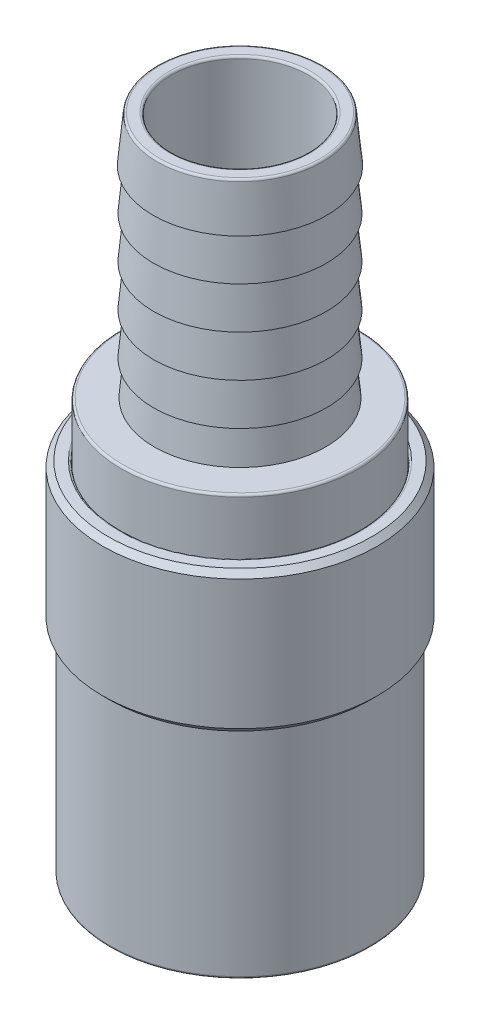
ISO-10303-21;
HEADER;
FILE_DESCRIPTION(('STEP AP214'),'2;1');
FILE_NAME('part.step','',(''),(''),'','','');
FILE_SCHEMA(('AUTOMOTIVE_DESIGN { 1 0 10303 214 1 1 1 1 }'));
ENDSEC;
DATA;
#1=APPLICATION_CONTEXT('core data for automotive mechanical design processes');
#2=APPLICATION_PROTOCOL_DEFINITION('international standard','automotive_design',2000,#1);
#3=PRODUCT_CONTEXT('',#1,'mechanical');
#4=PRODUCT('Part','Part','',(#3));
#5=PRODUCT_RELATED_PRODUCT_CATEGORY('part','',(#4));
#6=PRODUCT_DEFINITION_FORMATION('','',#4);
#7=PRODUCT_DEFINITION_CONTEXT('part definition',#1,'design');
#8=PRODUCT_DEFINITION('design','',#6,#7);
#9=PRODUCT_DEFINITION_SHAPE('','',#8);
#10=(LENGTH_UNIT() NAMED_UNIT(*) SI_UNIT(.MILLI.,.METRE.));
#11=(NAMED_UNIT(*) PLANE_ANGLE_UNIT() SI_UNIT($,.RADIAN.));
#12=(NAMED_UNIT(*) SI_UNIT($,.STERADIAN.) SOLID_ANGLE_UNIT());
#13=UNCERTAINTY_MEASURE_WITH_UNIT(LENGTH_MEASURE(1.E-05),#10,'distance_accuracy_value','');
#14=(GEOMETRIC_REPRESENTATION_CONTEXT(3) GLOBAL_UNCERTAINTY_ASSIGNED_CONTEXT((#13)) GLOBAL_UNIT_ASSIGNED_CONTEXT((#10,
#11,#12)) REPRESENTATION_CONTEXT('',''));
#15=CARTESIAN_POINT('',(0.,0.,0.));
#16=DIRECTION('',(0.,0.,1.));
#17=DIRECTION('',(1.,0.,0.));
#18=AXIS2_PLACEMENT_3D('',#15,#16,#17);
#19=CARTESIAN_POINT('',(0.,75.946,0.));
#20=DIRECTION('',(0.,1.,0.));
#21=DIRECTION('',(0.,0.,1.));
#22=AXIS2_PLACEMENT_3D('',#19,#20,#21);
#23=TOROIDAL_SURFACE('',#22,8.1788,0.254);
#24=CARTESIAN_POINT('',(0.,75.946,0.));
#25=DIRECTION('',(0.,-1.,0.));
#26=DIRECTION('',(0.,0.,-1.));
#27=AXIS2_PLACEMENT_3D('',#24,#25,#26);
#28=CIRCLE('',#27,7.9248);
#29=CARTESIAN_POINT('',(0.,75.946,7.9248));
#30=VERTEX_POINT('',#29);
#31=CARTESIAN_POINT('',(0.,75.946,-7.9248));
#32=VERTEX_POINT('',#31);
#33=EDGE_CURVE('P0_E11',#30,#32,#28,.T.);
#34=ORIENTED_EDGE('',*,*,#33,.T.);
#35=CARTESIAN_POINT('',(0.,75.946,-8.1788));
#36=DIRECTION('',(-1.,0.,0.));
#37=DIRECTION('',(0.,0.,-1.));
#38=AXIS2_PLACEMENT_3D('',#35,#36,#37);
#39=CIRCLE('',#38,0.254);
#40=CARTESIAN_POINT('',(0.,76.2,-8.1788));
#41=VERTEX_POINT('',#40);
#42=EDGE_CURVE('P0_E27',#32,#41,#39,.T.);
#43=ORIENTED_EDGE('',*,*,#42,.T.);
#44=CARTESIAN_POINT('',(0.,76.2,0.));
#45=DIRECTION('',(0.,1.,0.));
#46=DIRECTION('',(0.,0.,-1.));
#47=AXIS2_PLACEMENT_3D('',#44,#45,#46);
#48=CIRCLE('',#47,8.1788);
#49=CARTESIAN_POINT('',(0.,76.2,8.1788));
#50=VERTEX_POINT('',#49);
#51=EDGE_CURVE('P0_E382',#41,#50,#48,.T.);
#52=ORIENTED_EDGE('',*,*,#51,.T.);
#53=CARTESIAN_POINT('',(0.,76.2,0.));
#54=DIRECTION('',(0.,1.,0.));
#55=DIRECTION('',(0.,0.,-1.));
#56=AXIS2_PLACEMENT_3D('',#53,#54,#55);
#57=CIRCLE('',#56,8.1788);
#58=EDGE_CURVE('P0_E348',#50,#41,#57,.T.);
#59=ORIENTED_EDGE('',*,*,#58,.T.);
#60=ORIENTED_EDGE('',*,*,#42,.F.);
#61=CARTESIAN_POINT('',(0.,75.946,0.));
#62=DIRECTION('',(0.,-1.,0.));
#63=DIRECTION('',(0.,0.,-1.));
#64=AXIS2_PLACEMENT_3D('',#61,#62,#63);
#65=CIRCLE('',#64,7.9248);
#66=EDGE_CURVE('P0_E41',#32,#30,#65,.T.);
#67=ORIENTED_EDGE('',*,*,#66,.T.);
#68=EDGE_LOOP('',(#34,#43,#52,#59,#60,#67));
#69=FACE_BOUND('',#68,.T.);
#70=ADVANCED_FACE('P0_F16',(#69),#23,.T.);
#71=CARTESIAN_POINT('',(0.,76.2,7.9248));
#72=DIRECTION('',(0.,1.,0.));
#73=DIRECTION('',(1.,0.,0.));
#74=AXIS2_PLACEMENT_3D('',#71,#72,#73);
#75=PLANE('',#74);
#76=CARTESIAN_POINT('',(0.,76.2,0.));
#77=DIRECTION('',(0.,-1.,0.));
#78=DIRECTION('',(0.,0.,-1.));
#79=AXIS2_PLACEMENT_3D('',#76,#77,#78);
#80=CIRCLE('',#79,9.29404114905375);
#81=CARTESIAN_POINT('',(0.,76.2,9.29404114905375));
#82=VERTEX_POINT('',#81);
#83=CARTESIAN_POINT('',(0.,76.2,-9.29404114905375));
#84=VERTEX_POINT('',#83);
#85=EDGE_CURVE('P0_E375',#82,#84,#80,.T.);
#86=ORIENTED_EDGE('',*,*,#85,.F.);
#87=CARTESIAN_POINT('',(0.,76.2,0.));
#88=DIRECTION('',(0.,-1.,0.));
#89=DIRECTION('',(0.,0.,-1.));
#90=AXIS2_PLACEMENT_3D('',#87,#88,#89);
#91=CIRCLE('',#90,9.29404114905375);
#92=EDGE_CURVE('P0_E419',#84,#82,#91,.T.);
#93=ORIENTED_EDGE('',*,*,#92,.F.);
#94=EDGE_LOOP('',(#86,#93));
#95=FACE_BOUND('',#94,.T.);
#96=ORIENTED_EDGE('',*,*,#58,.F.);
#97=ORIENTED_EDGE('',*,*,#51,.F.);
#98=EDGE_LOOP('',(#96,#97));
#99=FACE_BOUND('',#98,.T.);
#100=ADVANCED_FACE('P0_F591',(#95,#99),#75,.T.);
#101=CARTESIAN_POINT('',(0.,50.0888,0.));
#102=DIRECTION('',(0.,1.,0.));
#103=DIRECTION('',(0.,0.,1.));
#104=AXIS2_PLACEMENT_3D('',#101,#102,#103);
#105=CYLINDRICAL_SURFACE('',#104,7.9248);
#106=ORIENTED_EDGE('',*,*,#33,.F.);
#107=ORIENTED_EDGE('',*,*,#66,.F.);
#108=DIRECTION('',(0.,-1.,0.));
#109=VECTOR('',#108,1.);
#110=CARTESIAN_POINT('',(0.,50.0888,-7.9248));
#111=LINE('',#110,#109);
#112=CARTESIAN_POINT('',(0.,23.9776,-7.9248));
#113=VERTEX_POINT('',#112);
#114=EDGE_CURVE('P0_E295',#32,#113,#111,.T.);
#115=ORIENTED_EDGE('',*,*,#114,.T.);
#116=CARTESIAN_POINT('',(0.,23.9776,0.));
#117=DIRECTION('',(0.,1.,0.));
#118=DIRECTION('',(1.,0.,0.));
#119=AXIS2_PLACEMENT_3D('',#116,#117,#118);
#120=CIRCLE('',#119,7.9248);
#121=CARTESIAN_POINT('',(0.,23.9776,7.9248));
#122=VERTEX_POINT('',#121);
#123=EDGE_CURVE('P0_E290',#122,#113,#120,.T.);
#124=ORIENTED_EDGE('',*,*,#123,.F.);
#125=CARTESIAN_POINT('',(0.,23.9776,0.));
#126=DIRECTION('',(0.,1.,0.));
#127=DIRECTION('',(1.,0.,0.));
#128=AXIS2_PLACEMENT_3D('',#125,#126,#127);
#129=CIRCLE('',#128,7.9248);
#130=EDGE_CURVE('P0_E294',#113,#122,#129,.T.);
#131=ORIENTED_EDGE('',*,*,#130,.F.);
#132=ORIENTED_EDGE('',*,*,#114,.F.);
#133=EDGE_LOOP('',(#106,#107,#115,#124,#131,#132));
#134=FACE_BOUND('',#133,.T.);
#135=ADVANCED_FACE('P0_F292',(#134),#105,.F.);
#136=CARTESIAN_POINT('',(0.,75.946,0.));
#137=DIRECTION('',(0.,1.,0.));
#138=DIRECTION('',(0.,0.,1.));
#139=AXIS2_PLACEMENT_3D('',#136,#137,#138);
#140=TOROIDAL_SURFACE('',#139,9.29404114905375,0.254);
#141=ORIENTED_EDGE('',*,*,#85,.T.);
#142=CARTESIAN_POINT('',(0.,75.946,-9.29404114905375));
#143=DIRECTION('',(-1.,0.,0.));
#144=DIRECTION('',(0.,0.,-1.));
#145=AXIS2_PLACEMENT_3D('',#142,#143,#144);
#146=CIRCLE('',#145,0.254);
#147=CARTESIAN_POINT('',(0.,75.9700815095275,-9.5468969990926));
#148=VERTEX_POINT('',#147);
#149=EDGE_CURVE('P0_E361',#84,#148,#146,.T.);
#150=ORIENTED_EDGE('',*,*,#149,.T.);
#151=CARTESIAN_POINT('',(0.,75.9700815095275,0.));
#152=DIRECTION('',(0.,1.,0.));
#153=DIRECTION('',(0.,0.,-1.));
#154=AXIS2_PLACEMENT_3D('',#151,#152,#153);
#155=CIRCLE('',#154,9.5468969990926);
#156=CARTESIAN_POINT('',(0.,75.9700815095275,9.5468969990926));
#157=VERTEX_POINT('',#156);
#158=EDGE_CURVE('P0_E357',#148,#157,#155,.T.);
#159=ORIENTED_EDGE('',*,*,#158,.T.);
#160=CARTESIAN_POINT('',(0.,75.9700815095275,0.));
#161=DIRECTION('',(0.,1.,0.));
#162=DIRECTION('',(0.,0.,-1.));
#163=AXIS2_PLACEMENT_3D('',#160,#161,#162);
#164=CIRCLE('',#163,9.5468969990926);
#165=EDGE_CURVE('P0_E362',#157,#148,#164,.T.);
#166=ORIENTED_EDGE('',*,*,#165,.T.);
#167=ORIENTED_EDGE('',*,*,#149,.F.);
#168=ORIENTED_EDGE('',*,*,#92,.T.);
#169=EDGE_LOOP('',(#141,#150,#159,#166,#167,#168));
#170=FACE_BOUND('',#169,.T.);
#171=ADVANCED_FACE('P0_F640',(#170),#140,.T.);
#172=CARTESIAN_POINT('',(0.,73.533,0.));
#173=DIRECTION('',(0.,-1.,0.));
#174=DIRECTION('',(0.,0.,1.));
#175=AXIS2_PLACEMENT_3D('',#172,#173,#174);
#176=CONICAL_SURFACE('',#175,9.779,0.0949517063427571);
#177=ORIENTED_EDGE('',*,*,#165,.F.);
#178=ORIENTED_EDGE('',*,*,#158,.F.);
#179=DIRECTION('',(0.,-0.995495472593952,-0.0948090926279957));
#180=VECTOR('',#179,1.);
#181=CARTESIAN_POINT('',(0.,73.533,-9.779));
#182=LINE('',#181,#180);
#183=CARTESIAN_POINT('',(0.,70.866,-10.033));
#184=VERTEX_POINT('',#183);
#185=EDGE_CURVE('P0_E417',#148,#184,#182,.T.);
#186=ORIENTED_EDGE('',*,*,#185,.T.);
#187=CARTESIAN_POINT('',(0.,70.866,0.));
#188=DIRECTION('',(0.,1.,0.));
#189=DIRECTION('',(1.,0.,0.));
#190=AXIS2_PLACEMENT_3D('',#187,#188,#189);
#191=CIRCLE('',#190,10.033);
#192=CARTESIAN_POINT('',(0.,70.866,10.033));
#193=VERTEX_POINT('',#192);
#194=EDGE_CURVE('P0_E113',#184,#193,#191,.T.);
#195=ORIENTED_EDGE('',*,*,#194,.T.);
#196=CARTESIAN_POINT('',(0.,70.866,0.));
#197=DIRECTION('',(0.,1.,0.));
#198=DIRECTION('',(1.,0.,0.));
#199=AXIS2_PLACEMENT_3D('',#196,#197,#198);
#200=CIRCLE('',#199,10.033);
#201=EDGE_CURVE('P0_E330',#193,#184,#200,.T.);
#202=ORIENTED_EDGE('',*,*,#201,.T.);
#203=ORIENTED_EDGE('',*,*,#185,.F.);
#204=EDGE_LOOP('',(#177,#178,#186,#195,#202,#203));
#205=FACE_BOUND('',#204,.T.);
#206=ADVANCED_FACE('P0_F586',(#205),#176,.T.);
#207=CARTESIAN_POINT('',(0.,0.254,0.));
#208=DIRECTION('',(0.,1.,0.));
#209=DIRECTION('',(0.,0.,1.));
#210=AXIS2_PLACEMENT_3D('',#207,#208,#209);
#211=TOROIDAL_SURFACE('',#210,11.8618,0.254);
#212=CARTESIAN_POINT('',(0.,0.254,0.));
#213=DIRECTION('',(0.,-1.,0.));
#214=DIRECTION('',(0.,0.,-1.));
#215=AXIS2_PLACEMENT_3D('',#212,#213,#214);
#216=CIRCLE('',#215,12.1158);
#217=CARTESIAN_POINT('',(0.,0.254,12.1158));
#218=VERTEX_POINT('',#217);
#219=CARTESIAN_POINT('',(0.,0.254,-12.1158));
#220=VERTEX_POINT('',#219);
#221=EDGE_CURVE('P0_E333',#218,#220,#216,.T.);
#222=ORIENTED_EDGE('',*,*,#221,.T.);
#223=CARTESIAN_POINT('',(0.,0.254,-11.8618));
#224=DIRECTION('',(-1.,0.,0.));
#225=DIRECTION('',(0.,0.,-1.));
#226=AXIS2_PLACEMENT_3D('',#223,#224,#225);
#227=CIRCLE('',#226,0.254);
#228=CARTESIAN_POINT('',(0.,0.,-11.8618));
#229=VERTEX_POINT('',#228);
#230=EDGE_CURVE('P0_E338',#220,#229,#227,.T.);
#231=ORIENTED_EDGE('',*,*,#230,.T.);
#232=CARTESIAN_POINT('',(0.,0.,0.));
#233=DIRECTION('',(0.,1.,0.));
#234=DIRECTION('',(0.,0.,-1.));
#235=AXIS2_PLACEMENT_3D('',#232,#233,#234);
#236=CIRCLE('',#235,11.8618);
#237=CARTESIAN_POINT('',(0.,0.,11.8618));
#238=VERTEX_POINT('',#237);
#239=EDGE_CURVE('P0_E334',#229,#238,#236,.T.);
#240=ORIENTED_EDGE('',*,*,#239,.T.);
#241=CARTESIAN_POINT('',(0.,0.,0.));
#242=DIRECTION('',(0.,1.,0.));
#243=DIRECTION('',(0.,0.,-1.));
#244=AXIS2_PLACEMENT_3D('',#241,#242,#243);
#245=CIRCLE('',#244,11.8618);
#246=EDGE_CURVE('P0_E339',#238,#229,#245,.T.);
#247=ORIENTED_EDGE('',*,*,#246,.T.);
#248=ORIENTED_EDGE('',*,*,#230,.F.);
#249=CARTESIAN_POINT('',(0.,0.254,0.));
#250=DIRECTION('',(0.,-1.,0.));
#251=DIRECTION('',(0.,0.,-1.));
#252=AXIS2_PLACEMENT_3D('',#249,#250,#251);
#253=CIRCLE('',#252,12.1158);
#254=EDGE_CURVE('P0_E129',#220,#218,#253,.T.);
#255=ORIENTED_EDGE('',*,*,#254,.T.);
#256=EDGE_LOOP('',(#222,#231,#240,#247,#248,#255));
#257=FACE_BOUND('',#256,.T.);
#258=ADVANCED_FACE('P0_F573',(#257),#211,.T.);
#259=CARTESIAN_POINT('',(0.,0.,12.1158));
#260=DIRECTION('',(0.,-1.,0.));
#261=DIRECTION('',(0.,0.,-1.));
#262=AXIS2_PLACEMENT_3D('',#259,#260,#261);
#263=PLANE('',#262);
#264=ORIENTED_EDGE('',*,*,#246,.F.);
#265=ORIENTED_EDGE('',*,*,#239,.F.);
#266=EDGE_LOOP('',(#264,#265));
#267=FACE_BOUND('',#266,.T.);
#268=CARTESIAN_POINT('',(0.,0.,0.));
#269=DIRECTION('',(0.,-1.,0.));
#270=DIRECTION('',(0.,0.,-1.));
#271=AXIS2_PLACEMENT_3D('',#268,#269,#270);
#272=CIRCLE('',#271,11.1760003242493);
#273=CARTESIAN_POINT('',(0.,0.,11.1760003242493));
#274=VERTEX_POINT('',#273);
#275=EDGE_CURVE('P0_E478',#274,#274,#272,.T.);
#276=ORIENTED_EDGE('',*,*,#275,.F.);
#277=EDGE_LOOP('',(#276));
#278=FACE_BOUND('',#277,.T.);
#279=ADVANCED_FACE('P0_F576',(#267,#278),#263,.T.);
#280=CARTESIAN_POINT('',(0.,8.1153,0.));
#281=DIRECTION('',(0.,1.,0.));
#282=DIRECTION('',(0.,0.,1.));
#283=AXIS2_PLACEMENT_3D('',#280,#281,#282);
#284=CYLINDRICAL_SURFACE('',#283,12.1158);
#285=CARTESIAN_POINT('',(0.,16.2306,0.));
#286=DIRECTION('',(0.,1.,0.));
#287=DIRECTION('',(1.,0.,0.));
#288=AXIS2_PLACEMENT_3D('',#285,#286,#287);
#289=CIRCLE('',#288,12.1158);
#290=CARTESIAN_POINT('',(0.,16.2306,12.1158));
#291=VERTEX_POINT('',#290);
#292=CARTESIAN_POINT('',(0.,16.2306,-12.1158));
#293=VERTEX_POINT('',#292);
#294=EDGE_CURVE('P0_E483',#291,#293,#289,.T.);
#295=ORIENTED_EDGE('',*,*,#294,.F.);
#296=CARTESIAN_POINT('',(0.,16.2306,0.));
#297=DIRECTION('',(0.,1.,0.));
#298=DIRECTION('',(1.,0.,0.));
#299=AXIS2_PLACEMENT_3D('',#296,#297,#298);
#300=CIRCLE('',#299,12.1158);
#301=EDGE_CURVE('P0_E315',#293,#291,#300,.T.);
#302=ORIENTED_EDGE('',*,*,#301,.F.);
#303=DIRECTION('',(0.,-1.,0.));
#304=VECTOR('',#303,1.);
#305=CARTESIAN_POINT('',(0.,8.1153,-12.1158));
#306=LINE('',#305,#304);
#307=EDGE_CURVE('P0_E368',#293,#220,#306,.T.);
#308=ORIENTED_EDGE('',*,*,#307,.T.);
#309=ORIENTED_EDGE('',*,*,#221,.F.);
#310=ORIENTED_EDGE('',*,*,#254,.F.);
#311=ORIENTED_EDGE('',*,*,#307,.F.);
#312=EDGE_LOOP('',(#295,#302,#308,#309,#310,#311));
#313=FACE_BOUND('',#312,.T.);
#314=ADVANCED_FACE('P0_F571',(#313),#284,.T.);
#315=CARTESIAN_POINT('',(0.,16.4846,0.));
#316=DIRECTION('',(0.,1.,0.));
#317=DIRECTION('',(0.,0.,1.));
#318=AXIS2_PLACEMENT_3D('',#315,#316,#317);
#319=TOROIDAL_SURFACE('',#318,13.4874,0.254);
#320=CARTESIAN_POINT('',(0.,16.4846,0.));
#321=DIRECTION('',(0.,-1.,0.));
#322=DIRECTION('',(0.,0.,-1.));
#323=AXIS2_PLACEMENT_3D('',#320,#321,#322);
#324=CIRCLE('',#323,13.7414);
#325=CARTESIAN_POINT('',(0.,16.4846,13.7414));
#326=VERTEX_POINT('',#325);
#327=CARTESIAN_POINT('',(0.,16.4846,-13.7414));
#328=VERTEX_POINT('',#327);
#329=EDGE_CURVE('P0_E209',#326,#328,#324,.T.);
#330=ORIENTED_EDGE('',*,*,#329,.T.);
#331=CARTESIAN_POINT('',(0.,16.4846,-13.4874));
#332=DIRECTION('',(-1.,0.,0.));
#333=DIRECTION('',(0.,0.,-1.));
#334=AXIS2_PLACEMENT_3D('',#331,#332,#333);
#335=CIRCLE('',#334,0.254);
#336=CARTESIAN_POINT('',(0.,16.2306,-13.4874));
#337=VERTEX_POINT('',#336);
#338=EDGE_CURVE('P0_E425',#328,#337,#335,.T.);
#339=ORIENTED_EDGE('',*,*,#338,.T.);
#340=CARTESIAN_POINT('',(0.,16.2306,0.));
#341=DIRECTION('',(0.,1.,0.));
#342=DIRECTION('',(0.,0.,-1.));
#343=AXIS2_PLACEMENT_3D('',#340,#341,#342);
#344=CIRCLE('',#343,13.4874);
#345=CARTESIAN_POINT('',(0.,16.2306,13.4874));
#346=VERTEX_POINT('',#345);
#347=EDGE_CURVE('P0_E428',#337,#346,#344,.T.);
#348=ORIENTED_EDGE('',*,*,#347,.T.);
#349=CARTESIAN_POINT('',(0.,16.2306,0.));
#350=DIRECTION('',(0.,1.,0.));
#351=DIRECTION('',(0.,0.,-1.));
#352=AXIS2_PLACEMENT_3D('',#349,#350,#351);
#353=CIRCLE('',#352,13.4874);
#354=EDGE_CURVE('P0_E352',#346,#337,#353,.T.);
#355=ORIENTED_EDGE('',*,*,#354,.T.);
#356=ORIENTED_EDGE('',*,*,#338,.F.);
#357=CARTESIAN_POINT('',(0.,16.4846,0.));
#358=DIRECTION('',(0.,-1.,0.));
#359=DIRECTION('',(0.,0.,-1.));
#360=AXIS2_PLACEMENT_3D('',#357,#358,#359);
#361=CIRCLE('',#360,13.7414);
#362=EDGE_CURVE('P0_E349',#328,#326,#361,.T.);
#363=ORIENTED_EDGE('',*,*,#362,.T.);
#364=EDGE_LOOP('',(#330,#339,#348,#355,#356,#363));
#365=FACE_BOUND('',#364,.T.);
#366=ADVANCED_FACE('P0_F562',(#365),#319,.T.);
#367=CARTESIAN_POINT('',(0.,31.9149084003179,0.));
#368=DIRECTION('',(0.,1.,0.));
#369=DIRECTION('',(0.,0.,1.));
#370=AXIS2_PLACEMENT_3D('',#367,#368,#369);
#371=CYLINDRICAL_SURFACE('',#370,13.7414);
#372=CARTESIAN_POINT('',(0.,47.3452168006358,0.));
#373=DIRECTION('',(0.,1.,0.));
#374=DIRECTION('',(0.,0.,-1.));
#375=AXIS2_PLACEMENT_3D('',#372,#373,#374);
#376=CIRCLE('',#375,13.7414);
#377=CARTESIAN_POINT('',(0.,47.3452168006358,13.7414));
#378=VERTEX_POINT('',#377);
#379=CARTESIAN_POINT('',(0.,47.3452168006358,-13.7414));
#380=VERTEX_POINT('',#379);
#381=EDGE_CURVE('P0_E221',#378,#380,#376,.T.);
#382=ORIENTED_EDGE('',*,*,#381,.F.);
#383=CARTESIAN_POINT('',(0.,47.3452168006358,0.));
#384=DIRECTION('',(0.,1.,0.));
#385=DIRECTION('',(0.,0.,-1.));
#386=AXIS2_PLACEMENT_3D('',#383,#384,#385);
#387=CIRCLE('',#386,13.7414);
#388=EDGE_CURVE('P0_E318',#380,#378,#387,.T.);
#389=ORIENTED_EDGE('',*,*,#388,.F.);
#390=DIRECTION('',(0.,-1.,0.));
#391=VECTOR('',#390,1.);
#392=CARTESIAN_POINT('',(0.,31.9149084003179,-13.7414));
#393=LINE('',#392,#391);
#394=EDGE_CURVE('P0_E353',#380,#328,#393,.T.);
#395=ORIENTED_EDGE('',*,*,#394,.T.);
#396=ORIENTED_EDGE('',*,*,#329,.F.);
#397=ORIENTED_EDGE('',*,*,#362,.F.);
#398=ORIENTED_EDGE('',*,*,#394,.F.);
#399=EDGE_LOOP('',(#382,#389,#395,#396,#397,#398));
#400=FACE_BOUND('',#399,.T.);
#401=ADVANCED_FACE('P0_F569',(#400),#371,.T.);
#402=CARTESIAN_POINT('',(0.,16.2306,13.7414));
#403=DIRECTION('',(0.,-1.,0.));
#404=DIRECTION('',(0.,0.,-1.));
#405=AXIS2_PLACEMENT_3D('',#402,#403,#404);
#406=PLANE('',#405);
#407=ORIENTED_EDGE('',*,*,#354,.F.);
#408=ORIENTED_EDGE('',*,*,#347,.F.);
#409=EDGE_LOOP('',(#407,#408));
#410=FACE_BOUND('',#409,.T.);
#411=ORIENTED_EDGE('',*,*,#294,.T.);
#412=ORIENTED_EDGE('',*,*,#301,.T.);
#413=EDGE_LOOP('',(#411,#412));
#414=FACE_BOUND('',#413,.T.);
#415=ADVANCED_FACE('P0_F565',(#410,#414),#406,.T.);
#416=CARTESIAN_POINT('',(0.,47.3452168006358,0.));
#417=DIRECTION('',(0.,1.,0.));
#418=DIRECTION('',(0.,0.,1.));
#419=AXIS2_PLACEMENT_3D('',#416,#417,#418);
#420=TOROIDAL_SURFACE('',#419,13.4874,0.254);
#421=CARTESIAN_POINT('',(0.,47.5992168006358,0.));
#422=DIRECTION('',(0.,-1.,0.));
#423=DIRECTION('',(0.,0.,-1.));
#424=AXIS2_PLACEMENT_3D('',#421,#422,#423);
#425=CIRCLE('',#424,13.4874);
#426=CARTESIAN_POINT('',(0.,47.5992168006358,13.4874));
#427=VERTEX_POINT('',#426);
#428=CARTESIAN_POINT('',(0.,47.5992168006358,-13.4874));
#429=VERTEX_POINT('',#428);
#430=EDGE_CURVE('P0_E235',#427,#429,#425,.T.);
#431=ORIENTED_EDGE('',*,*,#430,.T.);
#432=CARTESIAN_POINT('',(0.,47.3452168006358,-13.4874));
#433=DIRECTION('',(-1.,0.,0.));
#434=DIRECTION('',(0.,0.,-1.));
#435=AXIS2_PLACEMENT_3D('',#432,#433,#434);
#436=CIRCLE('',#435,0.254);
#437=EDGE_CURVE('P0_E245',#429,#380,#436,.T.);
#438=ORIENTED_EDGE('',*,*,#437,.T.);
#439=ORIENTED_EDGE('',*,*,#388,.T.);
#440=ORIENTED_EDGE('',*,*,#381,.T.);
#441=ORIENTED_EDGE('',*,*,#437,.F.);
#442=CARTESIAN_POINT('',(0.,47.5992168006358,0.));
#443=DIRECTION('',(0.,-1.,0.));
#444=DIRECTION('',(0.,0.,-1.));
#445=AXIS2_PLACEMENT_3D('',#442,#443,#444);
#446=CIRCLE('',#445,13.4874);
#447=EDGE_CURVE('P0_E520',#429,#427,#446,.T.);
#448=ORIENTED_EDGE('',*,*,#447,.T.);
#449=EDGE_LOOP('',(#431,#438,#439,#440,#441,#448));
#450=FACE_BOUND('',#449,.T.);
#451=ADVANCED_FACE('P0_F568',(#450),#420,.T.);
#452=CARTESIAN_POINT('',(0.,47.5992168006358,9.90240792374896));
#453=DIRECTION('',(0.,1.,0.));
#454=DIRECTION('',(1.,0.,0.));
#455=AXIS2_PLACEMENT_3D('',#452,#453,#454);
#456=PLANE('',#455);
#457=ORIENTED_EDGE('',*,*,#430,.F.);
#458=ORIENTED_EDGE('',*,*,#447,.F.);
#459=EDGE_LOOP('',(#457,#458));
#460=FACE_BOUND('',#459,.T.);
#461=CARTESIAN_POINT('',(0.,47.5992168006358,0.));
#462=DIRECTION('',(0.,1.,0.));
#463=DIRECTION('',(1.,0.,0.));
#464=AXIS2_PLACEMENT_3D('',#461,#462,#463);
#465=CIRCLE('',#464,9.90240792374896);
#466=CARTESIAN_POINT('',(0.,47.5992168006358,9.90240792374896));
#467=VERTEX_POINT('',#466);
#468=CARTESIAN_POINT('',(0.,47.5992168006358,-9.90240792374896));
#469=VERTEX_POINT('',#468);
#470=EDGE_CURVE('P0_E395',#467,#469,#465,.T.);
#471=ORIENTED_EDGE('',*,*,#470,.F.);
#472=CARTESIAN_POINT('',(0.,47.5992168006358,0.));
#473=DIRECTION('',(0.,1.,0.));
#474=DIRECTION('',(1.,0.,0.));
#475=AXIS2_PLACEMENT_3D('',#472,#473,#474);
#476=CIRCLE('',#475,9.90240792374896);
#477=EDGE_CURVE('P0_E390',#469,#467,#476,.T.);
#478=ORIENTED_EDGE('',*,*,#477,.F.);
#479=EDGE_LOOP('',(#471,#478));
#480=FACE_BOUND('',#479,.T.);
#481=ADVANCED_FACE('P0_F642',(#460,#480),#456,.T.);
#482=CARTESIAN_POINT('',(0.,0.508,0.));
#483=DIRECTION('',(0.,-1.,0.));
#484=DIRECTION('',(0.,0.,-1.));
#485=AXIS2_PLACEMENT_3D('',#482,#483,#484);
#486=CONICAL_SURFACE('',#485,10.6680003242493,0.785398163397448);
#487=ORIENTED_EDGE('',*,*,#275,.T.);
#488=DIRECTION('',(0.,0.707106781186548,-0.707106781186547));
#489=VECTOR('',#488,1.);
#490=CARTESIAN_POINT('',(0.,0.508,10.6680003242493));
#491=LINE('',#490,#489);
#492=CARTESIAN_POINT('',(0.,1.016,10.1600003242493));
#493=VERTEX_POINT('',#492);
#494=EDGE_CURVE('P0_E474',#274,#493,#491,.T.);
#495=ORIENTED_EDGE('',*,*,#494,.T.);
#496=CARTESIAN_POINT('',(0.,1.016,0.));
#497=DIRECTION('',(0.,1.,0.));
#498=DIRECTION('',(0.,0.,-1.));
#499=AXIS2_PLACEMENT_3D('',#496,#497,#498);
#500=CIRCLE('',#499,10.1600003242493);
#501=CARTESIAN_POINT('',(0.,1.016,-10.1600003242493));
#502=VERTEX_POINT('',#501);
#503=EDGE_CURVE('P0_E444',#493,#502,#500,.T.);
#504=ORIENTED_EDGE('',*,*,#503,.T.);
#505=CARTESIAN_POINT('',(0.,1.016,0.));
#506=DIRECTION('',(0.,1.,0.));
#507=DIRECTION('',(0.,0.,-1.));
#508=AXIS2_PLACEMENT_3D('',#505,#506,#507);
#509=CIRCLE('',#508,10.1600003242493);
#510=EDGE_CURVE('P0_E457',#502,#493,#509,.T.);
#511=ORIENTED_EDGE('',*,*,#510,.T.);
#512=ORIENTED_EDGE('',*,*,#494,.F.);
#513=EDGE_LOOP('',(#487,#495,#504,#511,#512));
#514=FACE_BOUND('',#513,.T.);
#515=ADVANCED_FACE('P0_F610',(#514),#486,.F.);
#516=CARTESIAN_POINT('',(0.,8.59790016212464,0.));
#517=DIRECTION('',(0.,1.,0.));
#518=DIRECTION('',(0.,0.,1.));
#519=AXIS2_PLACEMENT_3D('',#516,#517,#518);
#520=CYLINDRICAL_SURFACE('',#519,10.1600003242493);
#521=CARTESIAN_POINT('',(0.,17.1958003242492,0.));
#522=DIRECTION('',(0.,1.,0.));
#523=DIRECTION('',(1.,0.,0.));
#524=AXIS2_PLACEMENT_3D('',#521,#522,#523);
#525=CIRCLE('',#524,10.1600003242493);
#526=CARTESIAN_POINT('',(0.,17.1958003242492,10.1600003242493));
#527=VERTEX_POINT('',#526);
#528=CARTESIAN_POINT('',(0.,17.1958003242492,-10.1600003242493));
#529=VERTEX_POINT('',#528);
#530=EDGE_CURVE('P0_E453',#527,#529,#525,.T.);
#531=ORIENTED_EDGE('',*,*,#530,.T.);
#532=DIRECTION('',(0.,-1.,0.));
#533=VECTOR('',#532,1.);
#534=CARTESIAN_POINT('',(0.,8.59790016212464,-10.1600003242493));
#535=LINE('',#534,#533);
#536=EDGE_CURVE('P0_E458',#529,#502,#535,.T.);
#537=ORIENTED_EDGE('',*,*,#536,.T.);
#538=ORIENTED_EDGE('',*,*,#503,.F.);
#539=ORIENTED_EDGE('',*,*,#510,.F.);
#540=ORIENTED_EDGE('',*,*,#536,.F.);
#541=CARTESIAN_POINT('',(0.,17.1958003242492,0.));
#542=DIRECTION('',(0.,1.,0.));
#543=DIRECTION('',(1.,0.,0.));
#544=AXIS2_PLACEMENT_3D('',#541,#542,#543);
#545=CIRCLE('',#544,10.1600003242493);
#546=EDGE_CURVE('P0_E298',#529,#527,#545,.T.);
#547=ORIENTED_EDGE('',*,*,#546,.T.);
#548=EDGE_LOOP('',(#531,#537,#538,#539,#540,#547));
#549=FACE_BOUND('',#548,.T.);
#550=ADVANCED_FACE('P0_F551',(#549),#520,.F.);
#551=CARTESIAN_POINT('',(0.,23.9776,10.668));
#552=DIRECTION('',(0.,-1.,0.));
#553=DIRECTION('',(0.,0.,-1.));
#554=AXIS2_PLACEMENT_3D('',#551,#552,#553);
#555=PLANE('',#554);
#556=CARTESIAN_POINT('',(0.,23.9776,0.));
#557=DIRECTION('',(0.,1.,0.));
#558=DIRECTION('',(1.,0.,0.));
#559=AXIS2_PLACEMENT_3D('',#556,#557,#558);
#560=CIRCLE('',#559,10.668);
#561=CARTESIAN_POINT('',(0.,23.9776,10.668));
#562=VERTEX_POINT('',#561);
#563=CARTESIAN_POINT('',(0.,23.9776,-10.668));
#564=VERTEX_POINT('',#563);
#565=EDGE_CURVE('P0_E302',#562,#564,#560,.T.);
#566=ORIENTED_EDGE('',*,*,#565,.F.);
#567=CARTESIAN_POINT('',(0.,23.9776,0.));
#568=DIRECTION('',(0.,1.,0.));
#569=DIRECTION('',(1.,0.,0.));
#570=AXIS2_PLACEMENT_3D('',#567,#568,#569);
#571=CIRCLE('',#570,10.668);
#572=EDGE_CURVE('P0_E383',#564,#562,#571,.T.);
#573=ORIENTED_EDGE('',*,*,#572,.F.);
#574=EDGE_LOOP('',(#566,#573));
#575=FACE_BOUND('',#574,.T.);
#576=ORIENTED_EDGE('',*,*,#123,.T.);
#577=ORIENTED_EDGE('',*,*,#130,.T.);
#578=EDGE_LOOP('',(#576,#577));
#579=FACE_BOUND('',#578,.T.);
#580=ADVANCED_FACE('P0_F300',(#575,#579),#555,.T.);
#581=CARTESIAN_POINT('',(0.,20.8407,0.));
#582=DIRECTION('',(0.,1.,0.));
#583=DIRECTION('',(0.,0.,1.));
#584=AXIS2_PLACEMENT_3D('',#581,#582,#583);
#585=CYLINDRICAL_SURFACE('',#584,10.668);
#586=ORIENTED_EDGE('',*,*,#565,.T.);
#587=DIRECTION('',(0.,-1.,0.));
#588=VECTOR('',#587,1.);
#589=CARTESIAN_POINT('',(0.,20.8407,-10.668));
#590=LINE('',#589,#588);
#591=CARTESIAN_POINT('',(0.,17.7038,-10.668));
#592=VERTEX_POINT('',#591);
#593=EDGE_CURVE('P0_E309',#564,#592,#590,.T.);
#594=ORIENTED_EDGE('',*,*,#593,.T.);
#595=CARTESIAN_POINT('',(0.,17.7038,0.));
#596=DIRECTION('',(0.,1.,0.));
#597=DIRECTION('',(1.,0.,0.));
#598=AXIS2_PLACEMENT_3D('',#595,#596,#597);
#599=CIRCLE('',#598,10.668);
#600=CARTESIAN_POINT('',(0.,17.7038,10.668));
#601=VERTEX_POINT('',#600);
#602=EDGE_CURVE('P0_E387',#601,#592,#599,.T.);
#603=ORIENTED_EDGE('',*,*,#602,.F.);
#604=CARTESIAN_POINT('',(0.,17.7038,0.));
#605=DIRECTION('',(0.,1.,0.));
#606=DIRECTION('',(1.,0.,0.));
#607=AXIS2_PLACEMENT_3D('',#604,#605,#606);
#608=CIRCLE('',#607,10.668);
#609=EDGE_CURVE('P0_E459',#592,#601,#608,.T.);
#610=ORIENTED_EDGE('',*,*,#609,.F.);
#611=ORIENTED_EDGE('',*,*,#593,.F.);
#612=ORIENTED_EDGE('',*,*,#572,.T.);
#613=EDGE_LOOP('',(#586,#594,#603,#610,#611,#612));
#614=FACE_BOUND('',#613,.T.);
#615=ADVANCED_FACE('P0_F545',(#614),#585,.F.);
#616=CARTESIAN_POINT('',(0.,17.4498001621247,0.));
#617=DIRECTION('',(0.,1.,0.));
#618=DIRECTION('',(0.,0.,1.));
#619=AXIS2_PLACEMENT_3D('',#616,#617,#618);
#620=CONICAL_SURFACE('',#619,10.4140001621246,0.785398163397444);
#621=ORIENTED_EDGE('',*,*,#602,.T.);
#622=DIRECTION('',(0.,-0.707106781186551,0.707106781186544));
#623=VECTOR('',#622,1.);
#624=CARTESIAN_POINT('',(0.,17.4498001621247,-10.4140001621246));
#625=LINE('',#624,#623);
#626=EDGE_CURVE('P0_E463',#592,#529,#625,.T.);
#627=ORIENTED_EDGE('',*,*,#626,.T.);
#628=ORIENTED_EDGE('',*,*,#530,.F.);
#629=ORIENTED_EDGE('',*,*,#546,.F.);
#630=ORIENTED_EDGE('',*,*,#626,.F.);
#631=ORIENTED_EDGE('',*,*,#609,.T.);
#632=EDGE_LOOP('',(#621,#627,#628,#629,#630,#631));
#633=FACE_BOUND('',#632,.T.);
#634=ADVANCED_FACE('P0_F547',(#633),#620,.F.);
#635=CARTESIAN_POINT('',(0.,49.5806084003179,0.));
#636=DIRECTION('',(0.,-1.,0.));
#637=DIRECTION('',(0.,0.,1.));
#638=AXIS2_PLACEMENT_3D('',#635,#636,#637);
#639=CONICAL_SURFACE('',#638,9.71370396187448,0.0949517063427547);
#640=CARTESIAN_POINT('',(0.,51.562,0.));
#641=DIRECTION('',(0.,1.,0.));
#642=DIRECTION('',(1.,0.,0.));
#643=AXIS2_PLACEMENT_3D('',#640,#641,#642);
#644=CIRCLE('',#643,9.525);
#645=CARTESIAN_POINT('',(0.,51.562,9.525));
#646=VERTEX_POINT('',#645);
#647=CARTESIAN_POINT('',(0.,51.562,-9.525));
#648=VERTEX_POINT('',#647);
#649=EDGE_CURVE('P0_E430',#646,#648,#644,.T.);
#650=ORIENTED_EDGE('',*,*,#649,.F.);
#651=CARTESIAN_POINT('',(0.,51.562,0.));
#652=DIRECTION('',(0.,1.,0.));
#653=DIRECTION('',(1.,0.,0.));
#654=AXIS2_PLACEMENT_3D('',#651,#652,#653);
#655=CIRCLE('',#654,9.525);
#656=EDGE_CURVE('P0_E20',#648,#646,#655,.T.);
#657=ORIENTED_EDGE('',*,*,#656,.F.);
#658=DIRECTION('',(0.,-0.995495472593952,-0.0948090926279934));
#659=VECTOR('',#658,1.);
#660=CARTESIAN_POINT('',(0.,49.5806084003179,-9.71370396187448));
#661=LINE('',#660,#659);
#662=EDGE_CURVE('P0_E394',#648,#469,#661,.T.);
#663=ORIENTED_EDGE('',*,*,#662,.T.);
#664=ORIENTED_EDGE('',*,*,#477,.T.);
#665=ORIENTED_EDGE('',*,*,#470,.T.);
#666=ORIENTED_EDGE('',*,*,#662,.F.);
#667=EDGE_LOOP('',(#650,#657,#663,#664,#665,#666));
#668=FACE_BOUND('',#667,.T.);
#669=ADVANCED_FACE('P0_F628',(#668),#639,.T.);
#670=CARTESIAN_POINT('',(0.,51.562,9.98461904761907));
#671=DIRECTION('',(0.,-1.,0.));
#672=DIRECTION('',(0.,0.,-1.));
#673=AXIS2_PLACEMENT_3D('',#670,#671,#672);
#674=PLANE('',#673);
#675=CARTESIAN_POINT('',(0.,51.562,0.));
#676=DIRECTION('',(0.,1.,0.));
#677=DIRECTION('',(1.,0.,0.));
#678=AXIS2_PLACEMENT_3D('',#675,#676,#677);
#679=CIRCLE('',#678,9.98461904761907);
#680=CARTESIAN_POINT('',(0.,51.562,9.98461904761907));
#681=VERTEX_POINT('',#680);
#682=CARTESIAN_POINT('',(0.,51.562,-9.98461904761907));
#683=VERTEX_POINT('',#682);
#684=EDGE_CURVE('P0_E399',#681,#683,#679,.T.);
#685=ORIENTED_EDGE('',*,*,#684,.F.);
#686=CARTESIAN_POINT('',(0.,51.562,0.));
#687=DIRECTION('',(0.,1.,0.));
#688=DIRECTION('',(1.,0.,0.));
#689=AXIS2_PLACEMENT_3D('',#686,#687,#688);
#690=CIRCLE('',#689,9.98461904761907);
#691=EDGE_CURVE('P0_E400',#683,#681,#690,.T.);
#692=ORIENTED_EDGE('',*,*,#691,.F.);
#693=EDGE_LOOP('',(#685,#692));
#694=FACE_BOUND('',#693,.T.);
#695=ORIENTED_EDGE('',*,*,#649,.T.);
#696=ORIENTED_EDGE('',*,*,#656,.T.);
#697=EDGE_LOOP('',(#695,#696));
#698=FACE_BOUND('',#697,.T.);
#699=ADVANCED_FACE('P0_F636',(#694,#698),#674,.T.);
#700=CARTESIAN_POINT('',(0.,53.975,0.));
#701=DIRECTION('',(0.,-1.,0.));
#702=DIRECTION('',(0.,0.,1.));
#703=AXIS2_PLACEMENT_3D('',#700,#701,#702);
#704=CONICAL_SURFACE('',#703,9.75480952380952,0.0949517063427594);
#705=CARTESIAN_POINT('',(0.,56.388,0.));
#706=DIRECTION('',(0.,1.,0.));
#707=DIRECTION('',(1.,0.,0.));
#708=AXIS2_PLACEMENT_3D('',#705,#706,#707);
#709=CIRCLE('',#708,9.525);
#710=CARTESIAN_POINT('',(0.,56.388,9.525));
#711=VERTEX_POINT('',#710);
#712=CARTESIAN_POINT('',(0.,56.388,-9.525));
#713=VERTEX_POINT('',#712);
#714=EDGE_CURVE('P0_E344',#711,#713,#709,.T.);
#715=ORIENTED_EDGE('',*,*,#714,.F.);
#716=CARTESIAN_POINT('',(0.,56.388,0.));
#717=DIRECTION('',(0.,1.,0.));
#718=DIRECTION('',(1.,0.,0.));
#719=AXIS2_PLACEMENT_3D('',#716,#717,#718);
#720=CIRCLE('',#719,9.525);
#721=EDGE_CURVE('P0_E340',#713,#711,#720,.T.);
#722=ORIENTED_EDGE('',*,*,#721,.F.);
#723=DIRECTION('',(0.,-0.995495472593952,-0.0948090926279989));
#724=VECTOR('',#723,1.);
#725=CARTESIAN_POINT('',(0.,53.975,-9.75480952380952));
#726=LINE('',#725,#724);
#727=EDGE_CURVE('P0_E404',#713,#683,#726,.T.);
#728=ORIENTED_EDGE('',*,*,#727,.T.);
#729=ORIENTED_EDGE('',*,*,#691,.T.);
#730=ORIENTED_EDGE('',*,*,#684,.T.);
#731=ORIENTED_EDGE('',*,*,#727,.F.);
#732=EDGE_LOOP('',(#715,#722,#728,#729,#730,#731));
#733=FACE_BOUND('',#732,.T.);
#734=ADVANCED_FACE('P0_F606',(#733),#704,.T.);
#735=CARTESIAN_POINT('',(0.,56.388,9.98461904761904));
#736=DIRECTION('',(0.,-1.,0.));
#737=DIRECTION('',(0.,0.,-1.));
#738=AXIS2_PLACEMENT_3D('',#735,#736,#737);
#739=PLANE('',#738);
#740=CARTESIAN_POINT('',(0.,56.388,0.));
#741=DIRECTION('',(0.,1.,0.));
#742=DIRECTION('',(1.,0.,0.));
#743=AXIS2_PLACEMENT_3D('',#740,#741,#742);
#744=CIRCLE('',#743,9.98461904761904);
#745=CARTESIAN_POINT('',(0.,56.388,9.98461904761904));
#746=VERTEX_POINT('',#745);
#747=CARTESIAN_POINT('',(0.,56.388,-9.98461904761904));
#748=VERTEX_POINT('',#747);
#749=EDGE_CURVE('P0_E470',#746,#748,#744,.T.);
#750=ORIENTED_EDGE('',*,*,#749,.F.);
#751=CARTESIAN_POINT('',(0.,56.388,0.));
#752=DIRECTION('',(0.,1.,0.));
#753=DIRECTION('',(1.,0.,0.));
#754=AXIS2_PLACEMENT_3D('',#751,#752,#753);
#755=CIRCLE('',#754,9.98461904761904);
#756=EDGE_CURVE('P0_E473',#748,#746,#755,.T.);
#757=ORIENTED_EDGE('',*,*,#756,.F.);
#758=EDGE_LOOP('',(#750,#757));
#759=FACE_BOUND('',#758,.T.);
#760=ORIENTED_EDGE('',*,*,#714,.T.);
#761=ORIENTED_EDGE('',*,*,#721,.T.);
#762=EDGE_LOOP('',(#760,#761));
#763=FACE_BOUND('',#762,.T.);
#764=ADVANCED_FACE('P0_F602',(#759,#763),#739,.T.);
#765=CARTESIAN_POINT('',(0.,58.801,0.));
#766=DIRECTION('',(0.,-1.,0.));
#767=DIRECTION('',(0.,0.,1.));
#768=AXIS2_PLACEMENT_3D('',#765,#766,#767);
#769=CONICAL_SURFACE('',#768,9.75480952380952,0.0949517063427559);
#770=CARTESIAN_POINT('',(0.,61.214,0.));
#771=DIRECTION('',(0.,1.,0.));
#772=DIRECTION('',(1.,0.,0.));
#773=AXIS2_PLACEMENT_3D('',#770,#771,#772);
#774=CIRCLE('',#773,9.525);
#775=CARTESIAN_POINT('',(0.,61.214,9.525));
#776=VERTEX_POINT('',#775);
#777=CARTESIAN_POINT('',(0.,61.214,-9.525));
#778=VERTEX_POINT('',#777);
#779=EDGE_CURVE('P0_E84',#776,#778,#774,.T.);
#780=ORIENTED_EDGE('',*,*,#779,.F.);
#781=CARTESIAN_POINT('',(0.,61.214,0.));
#782=DIRECTION('',(0.,1.,0.));
#783=DIRECTION('',(1.,0.,0.));
#784=AXIS2_PLACEMENT_3D('',#781,#782,#783);
#785=CIRCLE('',#784,9.525);
#786=EDGE_CURVE('P0_E97',#778,#776,#785,.T.);
#787=ORIENTED_EDGE('',*,*,#786,.F.);
#788=DIRECTION('',(0.,-0.995495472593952,-0.0948090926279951));
#789=VECTOR('',#788,1.);
#790=CARTESIAN_POINT('',(0.,58.801,-9.75480952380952));
#791=LINE('',#790,#789);
#792=EDGE_CURVE('P0_E345',#778,#748,#791,.T.);
#793=ORIENTED_EDGE('',*,*,#792,.T.);
#794=ORIENTED_EDGE('',*,*,#756,.T.);
#795=ORIENTED_EDGE('',*,*,#749,.T.);
#796=ORIENTED_EDGE('',*,*,#792,.F.);
#797=EDGE_LOOP('',(#780,#787,#793,#794,#795,#796));
#798=FACE_BOUND('',#797,.T.);
#799=ADVANCED_FACE('P0_F605',(#798),#769,.T.);
#800=CARTESIAN_POINT('',(0.,61.214,9.98461904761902));
#801=DIRECTION('',(0.,-1.,0.));
#802=DIRECTION('',(0.,0.,-1.));
#803=AXIS2_PLACEMENT_3D('',#800,#801,#802);
#804=PLANE('',#803);
#805=CARTESIAN_POINT('',(0.,61.214,0.));
#806=DIRECTION('',(0.,1.,0.));
#807=DIRECTION('',(1.,0.,0.));
#808=AXIS2_PLACEMENT_3D('',#805,#806,#807);
#809=CIRCLE('',#808,9.98461904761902);
#810=CARTESIAN_POINT('',(0.,61.214,9.98461904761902));
#811=VERTEX_POINT('',#810);
#812=CARTESIAN_POINT('',(0.,61.214,-9.98461904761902));
#813=VERTEX_POINT('',#812);
#814=EDGE_CURVE('P0_E319',#811,#813,#809,.T.);
#815=ORIENTED_EDGE('',*,*,#814,.F.);
#816=CARTESIAN_POINT('',(0.,61.214,0.));
#817=DIRECTION('',(0.,1.,0.));
#818=DIRECTION('',(1.,0.,0.));
#819=AXIS2_PLACEMENT_3D('',#816,#817,#818);
#820=CIRCLE('',#819,9.98461904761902);
#821=EDGE_CURVE('P0_E323',#813,#811,#820,.T.);
#822=ORIENTED_EDGE('',*,*,#821,.F.);
#823=EDGE_LOOP('',(#815,#822));
#824=FACE_BOUND('',#823,.T.);
#825=ORIENTED_EDGE('',*,*,#779,.T.);
#826=ORIENTED_EDGE('',*,*,#786,.T.);
#827=EDGE_LOOP('',(#825,#826));
#828=FACE_BOUND('',#827,.T.);
#829=ADVANCED_FACE('P0_F618',(#824,#828),#804,.T.);
#830=CARTESIAN_POINT('',(0.,63.627,0.));
#831=DIRECTION('',(0.,-1.,0.));
#832=DIRECTION('',(0.,0.,1.));
#833=AXIS2_PLACEMENT_3D('',#830,#831,#832);
#834=CONICAL_SURFACE('',#833,9.75480952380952,0.0949517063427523);
#835=CARTESIAN_POINT('',(0.,66.04,0.));
#836=DIRECTION('',(0.,1.,0.));
#837=DIRECTION('',(1.,0.,0.));
#838=AXIS2_PLACEMENT_3D('',#835,#836,#837);
#839=CIRCLE('',#838,9.525);
#840=CARTESIAN_POINT('',(0.,66.04,9.525));
#841=VERTEX_POINT('',#840);
#842=CARTESIAN_POINT('',(0.,66.04,-9.525));
#843=VERTEX_POINT('',#842);
#844=EDGE_CURVE('P0_E324',#841,#843,#839,.T.);
#845=ORIENTED_EDGE('',*,*,#844,.F.);
#846=CARTESIAN_POINT('',(0.,66.04,0.));
#847=DIRECTION('',(0.,1.,0.));
#848=DIRECTION('',(1.,0.,0.));
#849=AXIS2_PLACEMENT_3D('',#846,#847,#848);
#850=CIRCLE('',#849,9.525);
#851=EDGE_CURVE('P0_E412',#843,#841,#850,.T.);
#852=ORIENTED_EDGE('',*,*,#851,.F.);
#853=DIRECTION('',(0.,-0.995495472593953,-0.0948090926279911));
#854=VECTOR('',#853,1.);
#855=CARTESIAN_POINT('',(0.,63.627,-9.75480952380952));
#856=LINE('',#855,#854);
#857=EDGE_CURVE('P0_E356',#843,#813,#856,.T.);
#858=ORIENTED_EDGE('',*,*,#857,.T.);
#859=ORIENTED_EDGE('',*,*,#821,.T.);
#860=ORIENTED_EDGE('',*,*,#814,.T.);
#861=ORIENTED_EDGE('',*,*,#857,.F.);
#862=EDGE_LOOP('',(#845,#852,#858,#859,#860,#861));
#863=FACE_BOUND('',#862,.T.);
#864=ADVANCED_FACE('P0_F616',(#863),#834,.T.);
#865=CARTESIAN_POINT('',(0.,66.04,9.98461904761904));
#866=DIRECTION('',(0.,-1.,0.));
#867=DIRECTION('',(0.,0.,-1.));
#868=AXIS2_PLACEMENT_3D('',#865,#866,#867);
#869=PLANE('',#868);
#870=CARTESIAN_POINT('',(0.,66.04,0.));
#871=DIRECTION('',(0.,1.,0.));
#872=DIRECTION('',(1.,0.,0.));
#873=AXIS2_PLACEMENT_3D('',#870,#871,#872);
#874=CIRCLE('',#873,9.98461904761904);
#875=CARTESIAN_POINT('',(0.,66.04,9.98461904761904));
#876=VERTEX_POINT('',#875);
#877=CARTESIAN_POINT('',(0.,66.04,-9.98461904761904));
#878=VERTEX_POINT('',#877);
#879=EDGE_CURVE('P0_E411',#876,#878,#874,.T.);
#880=ORIENTED_EDGE('',*,*,#879,.F.);
#881=CARTESIAN_POINT('',(0.,66.04,0.));
#882=DIRECTION('',(0.,1.,0.));
#883=DIRECTION('',(1.,0.,0.));
#884=AXIS2_PLACEMENT_3D('',#881,#882,#883);
#885=CIRCLE('',#884,9.98461904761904);
#886=EDGE_CURVE('P0_E424',#878,#876,#885,.T.);
#887=ORIENTED_EDGE('',*,*,#886,.F.);
#888=EDGE_LOOP('',(#880,#887));
#889=FACE_BOUND('',#888,.T.);
#890=ORIENTED_EDGE('',*,*,#844,.T.);
#891=ORIENTED_EDGE('',*,*,#851,.T.);
#892=EDGE_LOOP('',(#890,#891));
#893=FACE_BOUND('',#892,.T.);
#894=ADVANCED_FACE('P0_F18',(#889,#893),#869,.T.);
#895=CARTESIAN_POINT('',(0.,68.453,0.));
#896=DIRECTION('',(0.,-1.,0.));
#897=DIRECTION('',(0.,0.,1.));
#898=AXIS2_PLACEMENT_3D('',#895,#896,#897);
#899=CONICAL_SURFACE('',#898,9.75480952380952,0.0949517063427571);
#900=CARTESIAN_POINT('',(0.,70.866,0.));
#901=DIRECTION('',(0.,1.,0.));
#902=DIRECTION('',(1.,0.,0.));
#903=AXIS2_PLACEMENT_3D('',#900,#901,#902);
#904=CIRCLE('',#903,9.525);
#905=CARTESIAN_POINT('',(0.,70.866,9.525));
#906=VERTEX_POINT('',#905);
#907=CARTESIAN_POINT('',(0.,70.866,-9.525));
#908=VERTEX_POINT('',#907);
#909=EDGE_CURVE('P0_E329',#906,#908,#904,.T.);
#910=ORIENTED_EDGE('',*,*,#909,.F.);
#911=CARTESIAN_POINT('',(0.,70.866,0.));
#912=DIRECTION('',(0.,1.,0.));
#913=DIRECTION('',(1.,0.,0.));
#914=AXIS2_PLACEMENT_3D('',#911,#912,#913);
#915=CIRCLE('',#914,9.525);
#916=EDGE_CURVE('P0_E325',#908,#906,#915,.T.);
#917=ORIENTED_EDGE('',*,*,#916,.F.);
#918=DIRECTION('',(0.,-0.995495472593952,-0.0948090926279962));
#919=VECTOR('',#918,1.);
#920=CARTESIAN_POINT('',(0.,68.453,-9.75480952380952));
#921=LINE('',#920,#919);
#922=EDGE_CURVE('P0_E416',#908,#878,#921,.T.);
#923=ORIENTED_EDGE('',*,*,#922,.T.);
#924=ORIENTED_EDGE('',*,*,#886,.T.);
#925=ORIENTED_EDGE('',*,*,#879,.T.);
#926=ORIENTED_EDGE('',*,*,#922,.F.);
#927=EDGE_LOOP('',(#910,#917,#923,#924,#925,#926));
#928=FACE_BOUND('',#927,.T.);
#929=ADVANCED_FACE('P0_F613',(#928),#899,.T.);
#930=CARTESIAN_POINT('',(0.,70.866,10.033));
#931=DIRECTION('',(0.,-1.,0.));
#932=DIRECTION('',(0.,0.,-1.));
#933=AXIS2_PLACEMENT_3D('',#930,#931,#932);
#934=PLANE('',#933);
#935=ORIENTED_EDGE('',*,*,#201,.F.);
#936=ORIENTED_EDGE('',*,*,#194,.F.);
#937=EDGE_LOOP('',(#935,#936));
#938=FACE_BOUND('',#937,.T.);
#939=ORIENTED_EDGE('',*,*,#909,.T.);
#940=ORIENTED_EDGE('',*,*,#916,.T.);
#941=EDGE_LOOP('',(#939,#940));
#942=FACE_BOUND('',#941,.T.);
#943=ADVANCED_FACE('P0_F611',(#938,#942),#934,.T.);
#944=CLOSED_SHELL('',(#70,#100,#135,#171,#206,#258,#279,#314,#366,#401,#415,#451,#481,#515,#550,
#580,#615,#634,#669,#699,#734,#764,#799,#829,#864,#894,#929,#943));
#945=MANIFOLD_SOLID_BREP('P0_B1',#944);
#946=CARTESIAN_POINT('',(0.,40.9575,0.));
#947=DIRECTION('',(0.,-1.,0.));
#948=DIRECTION('',(0.,0.,1.));
#949=AXIS2_PLACEMENT_3D('',#946,#947,#948);
#950=CONICAL_SURFACE('',#949,15.5448,0.785398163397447);
#951=CARTESIAN_POINT('',(0.,40.64,0.));
#952=DIRECTION('',(0.,1.,0.));
#953=DIRECTION('',(0.,0.,1.));
#954=AXIS2_PLACEMENT_3D('',#951,#952,#953);
#955=CIRCLE('',#954,15.8623);
#956=CARTESIAN_POINT('',(0.,40.64,-15.8623));
#957=VERTEX_POINT('',#956);
#958=CARTESIAN_POINT('',(0.,40.64,15.8623));
#959=VERTEX_POINT('',#958);
#960=EDGE_CURVE('P1_E11',#957,#959,#955,.T.);
#961=ORIENTED_EDGE('',*,*,#960,.T.);
#962=CARTESIAN_POINT('',(0.,40.64,0.));
#963=DIRECTION('',(0.,1.,0.));
#964=DIRECTION('',(0.,0.,1.));
#965=AXIS2_PLACEMENT_3D('',#962,#963,#964);
#966=CIRCLE('',#965,15.8623);
#967=EDGE_CURVE('P1_E26',#959,#957,#966,.T.);
#968=ORIENTED_EDGE('',*,*,#967,.T.);
#969=DIRECTION('',(0.,0.707106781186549,0.707106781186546));
#970=VECTOR('',#969,1.);
#971=CARTESIAN_POINT('',(0.,40.9575,-15.5448));
#972=LINE('',#971,#970);
#973=CARTESIAN_POINT('',(0.,41.275,-15.2273));
#974=VERTEX_POINT('',#973);
#975=EDGE_CURVE('P1_E243',#957,#974,#972,.T.);
#976=ORIENTED_EDGE('',*,*,#975,.T.);
#977=CARTESIAN_POINT('',(0.,41.275,0.));
#978=DIRECTION('',(0.,-1.,0.));
#979=DIRECTION('',(0.,0.,1.));
#980=AXIS2_PLACEMENT_3D('',#977,#978,#979);
#981=CIRCLE('',#980,15.2273);
#982=EDGE_CURVE('P1_E170',#974,#974,#981,.T.);
#983=ORIENTED_EDGE('',*,*,#982,.T.);
#984=ORIENTED_EDGE('',*,*,#975,.F.);
#985=EDGE_LOOP('',(#961,#968,#976,#983,#984));
#986=FACE_BOUND('',#985,.T.);
#987=ADVANCED_FACE('P1_F16',(#986),#950,.T.);
#988=CARTESIAN_POINT('',(0.,41.275,-15.8623));
#989=DIRECTION('',(0.,1.,0.));
#990=DIRECTION('',(1.,0.,0.));
#991=AXIS2_PLACEMENT_3D('',#988,#989,#990);
#992=PLANE('',#991);
#993=ORIENTED_EDGE('',*,*,#982,.F.);
#994=EDGE_LOOP('',(#993));
#995=FACE_BOUND('',#994,.T.);
#996=CARTESIAN_POINT('',(0.,41.275,0.));
#997=DIRECTION('',(0.,1.,0.));
#998=DIRECTION('',(0.,0.,1.));
#999=AXIS2_PLACEMENT_3D('',#996,#997,#998);
#1000=CIRCLE('',#999,14.0335);
#1001=CARTESIAN_POINT('',(0.,41.275,-14.0335));
#1002=VERTEX_POINT('',#1001);
#1003=CARTESIAN_POINT('',(0.,41.275,14.0335));
#1004=VERTEX_POINT('',#1003);
#1005=EDGE_CURVE('P1_E162',#1002,#1004,#1000,.T.);
#1006=ORIENTED_EDGE('',*,*,#1005,.F.);
#1007=CARTESIAN_POINT('',(0.,41.275,0.));
#1008=DIRECTION('',(0.,1.,0.));
#1009=DIRECTION('',(0.,0.,1.));
#1010=AXIS2_PLACEMENT_3D('',#1007,#1008,#1009);
#1011=CIRCLE('',#1010,14.0335);
#1012=EDGE_CURVE('P1_E132',#1004,#1002,#1011,.T.);
#1013=ORIENTED_EDGE('',*,*,#1012,.F.);
#1014=EDGE_LOOP('',(#1006,#1013));
#1015=FACE_BOUND('',#1014,.T.);
#1016=ADVANCED_FACE('P1_F287',(#995,#1015),#992,.T.);
#1017=CARTESIAN_POINT('',(0.,33.4645,0.));
#1018=DIRECTION('',(0.,-1.,0.));
#1019=DIRECTION('',(0.,0.,-1.));
#1020=AXIS2_PLACEMENT_3D('',#1017,#1018,#1019);
#1021=CYLINDRICAL_SURFACE('',#1020,15.8623);
#1022=CARTESIAN_POINT('',(0.,25.654,0.));
#1023=DIRECTION('',(0.,-1.,0.));
#1024=DIRECTION('',(1.,0.,0.));
#1025=AXIS2_PLACEMENT_3D('',#1022,#1023,#1024);
#1026=CIRCLE('',#1025,15.8623);
#1027=CARTESIAN_POINT('',(0.,25.654,-15.8623));
#1028=VERTEX_POINT('',#1027);
#1029=CARTESIAN_POINT('',(0.,25.654,15.8623));
#1030=VERTEX_POINT('',#1029);
#1031=EDGE_CURVE('P1_E225',#1028,#1030,#1026,.T.);
#1032=ORIENTED_EDGE('',*,*,#1031,.F.);
#1033=CARTESIAN_POINT('',(0.,25.654,0.));
#1034=DIRECTION('',(0.,-1.,0.));
#1035=DIRECTION('',(1.,0.,0.));
#1036=AXIS2_PLACEMENT_3D('',#1033,#1034,#1035);
#1037=CIRCLE('',#1036,15.8623);
#1038=EDGE_CURVE('P1_E190',#1030,#1028,#1037,.T.);
#1039=ORIENTED_EDGE('',*,*,#1038,.F.);
#1040=DIRECTION('',(0.,1.,0.));
#1041=VECTOR('',#1040,1.);
#1042=CARTESIAN_POINT('',(0.,33.4645,15.8623));
#1043=LINE('',#1042,#1041);
#1044=EDGE_CURVE('P1_E166',#1030,#959,#1043,.T.);
#1045=ORIENTED_EDGE('',*,*,#1044,.T.);
#1046=ORIENTED_EDGE('',*,*,#960,.F.);
#1047=ORIENTED_EDGE('',*,*,#967,.F.);
#1048=ORIENTED_EDGE('',*,*,#1044,.F.);
#1049=EDGE_LOOP('',(#1032,#1039,#1045,#1046,#1047,#1048));
#1050=FACE_BOUND('',#1049,.T.);
#1051=ADVANCED_FACE('P1_F293',(#1050),#1021,.T.);
#1052=CARTESIAN_POINT('',(0.,4.953,0.));
#1053=DIRECTION('',(0.,-1.,0.));
#1054=DIRECTION('',(0.,0.,-1.));
#1055=AXIS2_PLACEMENT_3D('',#1052,#1053,#1054);
#1056=TOROIDAL_SURFACE('',#1055,12.446,0.254);
#1057=CARTESIAN_POINT('',(0.,5.207,0.));
#1058=DIRECTION('',(0.,1.,0.));
#1059=DIRECTION('',(0.,0.,1.));
#1060=AXIS2_PLACEMENT_3D('',#1057,#1058,#1059);
#1061=CIRCLE('',#1060,12.446);
#1062=CARTESIAN_POINT('',(0.,5.207,-12.446));
#1063=VERTEX_POINT('',#1062);
#1064=CARTESIAN_POINT('',(0.,5.207,12.446));
#1065=VERTEX_POINT('',#1064);
#1066=EDGE_CURVE('P1_E147',#1063,#1065,#1061,.T.);
#1067=ORIENTED_EDGE('',*,*,#1066,.T.);
#1068=CARTESIAN_POINT('',(0.,4.953,12.446));
#1069=DIRECTION('',(-1.,0.,0.));
#1070=DIRECTION('',(0.,0.,1.));
#1071=AXIS2_PLACEMENT_3D('',#1068,#1069,#1070);
#1072=CIRCLE('',#1071,0.254);
#1073=CARTESIAN_POINT('',(0.,4.953,12.192));
#1074=VERTEX_POINT('',#1073);
#1075=EDGE_CURVE('P1_E144',#1065,#1074,#1072,.T.);
#1076=ORIENTED_EDGE('',*,*,#1075,.T.);
#1077=CARTESIAN_POINT('',(0.,4.953,0.));
#1078=DIRECTION('',(0.,-1.,0.));
#1079=DIRECTION('',(0.,0.,1.));
#1080=AXIS2_PLACEMENT_3D('',#1077,#1078,#1079);
#1081=CIRCLE('',#1080,12.192);
#1082=CARTESIAN_POINT('',(0.,4.953,-12.192));
#1083=VERTEX_POINT('',#1082);
#1084=EDGE_CURVE('P1_E148',#1074,#1083,#1081,.T.);
#1085=ORIENTED_EDGE('',*,*,#1084,.T.);
#1086=CARTESIAN_POINT('',(0.,4.953,0.));
#1087=DIRECTION('',(0.,-1.,0.));
#1088=DIRECTION('',(0.,0.,1.));
#1089=AXIS2_PLACEMENT_3D('',#1086,#1087,#1088);
#1090=CIRCLE('',#1089,12.192);
#1091=EDGE_CURVE('P1_E161',#1083,#1074,#1090,.T.);
#1092=ORIENTED_EDGE('',*,*,#1091,.T.);
#1093=ORIENTED_EDGE('',*,*,#1075,.F.);
#1094=CARTESIAN_POINT('',(0.,5.207,0.));
#1095=DIRECTION('',(0.,1.,0.));
#1096=DIRECTION('',(0.,0.,1.));
#1097=AXIS2_PLACEMENT_3D('',#1094,#1095,#1096);
#1098=CIRCLE('',#1097,12.446);
#1099=EDGE_CURVE('P1_E204',#1065,#1063,#1098,.T.);
#1100=ORIENTED_EDGE('',*,*,#1099,.T.);
#1101=EDGE_LOOP('',(#1067,#1076,#1085,#1092,#1093,#1100));
#1102=FACE_BOUND('',#1101,.T.);
#1103=ADVANCED_FACE('P1_F211',(#1102),#1056,.T.);
#1104=CARTESIAN_POINT('',(0.,2.6035,0.));
#1105=DIRECTION('',(0.,-1.,0.));
#1106=DIRECTION('',(0.,0.,-1.));
#1107=AXIS2_PLACEMENT_3D('',#1104,#1105,#1106);
#1108=CYLINDRICAL_SURFACE('',#1107,12.192);
#1109=CARTESIAN_POINT('',(0.,0.254,0.));
#1110=DIRECTION('',(0.,1.,0.));
#1111=DIRECTION('',(0.,0.,1.));
#1112=AXIS2_PLACEMENT_3D('',#1109,#1110,#1111);
#1113=CIRCLE('',#1112,12.192);
#1114=CARTESIAN_POINT('',(0.,0.254,-12.192));
#1115=VERTEX_POINT('',#1114);
#1116=CARTESIAN_POINT('',(0.,0.254,12.192));
#1117=VERTEX_POINT('',#1116);
#1118=EDGE_CURVE('P1_E219',#1115,#1117,#1113,.T.);
#1119=ORIENTED_EDGE('',*,*,#1118,.F.);
#1120=CARTESIAN_POINT('',(0.,0.254,0.));
#1121=DIRECTION('',(0.,1.,0.));
#1122=DIRECTION('',(0.,0.,1.));
#1123=AXIS2_PLACEMENT_3D('',#1120,#1121,#1122);
#1124=CIRCLE('',#1123,12.192);
#1125=EDGE_CURVE('P1_E158',#1117,#1115,#1124,.T.);
#1126=ORIENTED_EDGE('',*,*,#1125,.F.);
#1127=DIRECTION('',(0.,1.,0.));
#1128=VECTOR('',#1127,1.);
#1129=CARTESIAN_POINT('',(0.,2.6035,12.192));
#1130=LINE('',#1129,#1128);
#1131=EDGE_CURVE('P1_E213',#1117,#1074,#1130,.T.);
#1132=ORIENTED_EDGE('',*,*,#1131,.T.);
#1133=ORIENTED_EDGE('',*,*,#1091,.F.);
#1134=ORIENTED_EDGE('',*,*,#1084,.F.);
#1135=ORIENTED_EDGE('',*,*,#1131,.F.);
#1136=EDGE_LOOP('',(#1119,#1126,#1132,#1133,#1134,#1135));
#1137=FACE_BOUND('',#1136,.T.);
#1138=ADVANCED_FACE('P1_F198',(#1137),#1108,.F.);
#1139=CARTESIAN_POINT('',(0.,5.207,-13.7795));
#1140=DIRECTION('',(0.,1.,0.));
#1141=DIRECTION('',(1.,0.,0.));
#1142=AXIS2_PLACEMENT_3D('',#1139,#1140,#1141);
#1143=PLANE('',#1142);
#1144=CARTESIAN_POINT('',(0.,5.207,0.));
#1145=DIRECTION('',(0.,-1.,0.));
#1146=DIRECTION('',(1.,0.,0.));
#1147=AXIS2_PLACEMENT_3D('',#1144,#1145,#1146);
#1148=CIRCLE('',#1147,13.7795);
#1149=CARTESIAN_POINT('',(0.,5.207,-13.7795));
#1150=VERTEX_POINT('',#1149);
#1151=CARTESIAN_POINT('',(0.,5.207,13.7795));
#1152=VERTEX_POINT('',#1151);
#1153=EDGE_CURVE('P1_E139',#1150,#1152,#1148,.T.);
#1154=ORIENTED_EDGE('',*,*,#1153,.F.);
#1155=CARTESIAN_POINT('',(0.,5.207,0.));
#1156=DIRECTION('',(0.,-1.,0.));
#1157=DIRECTION('',(1.,0.,0.));
#1158=AXIS2_PLACEMENT_3D('',#1155,#1156,#1157);
#1159=CIRCLE('',#1158,13.7795);
#1160=EDGE_CURVE('P1_E175',#1152,#1150,#1159,.T.);
#1161=ORIENTED_EDGE('',*,*,#1160,.F.);
#1162=EDGE_LOOP('',(#1154,#1161));
#1163=FACE_BOUND('',#1162,.T.);
#1164=ORIENTED_EDGE('',*,*,#1066,.F.);
#1165=ORIENTED_EDGE('',*,*,#1099,.F.);
#1166=EDGE_LOOP('',(#1164,#1165));
#1167=FACE_BOUND('',#1166,.T.);
#1168=ADVANCED_FACE('P1_F194',(#1163,#1167),#1143,.T.);
#1169=CARTESIAN_POINT('',(0.,0.254,0.));
#1170=DIRECTION('',(0.,-1.,0.));
#1171=DIRECTION('',(0.,0.,-1.));
#1172=AXIS2_PLACEMENT_3D('',#1169,#1170,#1171);
#1173=TOROIDAL_SURFACE('',#1172,12.446,0.254);
#1174=ORIENTED_EDGE('',*,*,#1118,.T.);
#1175=CARTESIAN_POINT('',(0.,0.254,12.446));
#1176=DIRECTION('',(-1.,0.,0.));
#1177=DIRECTION('',(0.,0.,1.));
#1178=AXIS2_PLACEMENT_3D('',#1175,#1176,#1177);
#1179=CIRCLE('',#1178,0.254);
#1180=CARTESIAN_POINT('',(0.,0.,12.446));
#1181=VERTEX_POINT('',#1180);
#1182=EDGE_CURVE('P1_E229',#1117,#1181,#1179,.T.);
#1183=ORIENTED_EDGE('',*,*,#1182,.T.);
#1184=CARTESIAN_POINT('',(0.,0.,0.));
#1185=DIRECTION('',(0.,-1.,0.));
#1186=DIRECTION('',(0.,0.,1.));
#1187=AXIS2_PLACEMENT_3D('',#1184,#1185,#1186);
#1188=CIRCLE('',#1187,12.446);
#1189=CARTESIAN_POINT('',(0.,0.,-12.446));
#1190=VERTEX_POINT('',#1189);
#1191=EDGE_CURVE('P1_E226',#1181,#1190,#1188,.T.);
#1192=ORIENTED_EDGE('',*,*,#1191,.T.);
#1193=CARTESIAN_POINT('',(0.,0.,0.));
#1194=DIRECTION('',(0.,-1.,0.));
#1195=DIRECTION('',(0.,0.,1.));
#1196=AXIS2_PLACEMENT_3D('',#1193,#1194,#1195);
#1197=CIRCLE('',#1196,12.446);
#1198=EDGE_CURVE('P1_E174',#1190,#1181,#1197,.T.);
#1199=ORIENTED_EDGE('',*,*,#1198,.T.);
#1200=ORIENTED_EDGE('',*,*,#1182,.F.);
#1201=ORIENTED_EDGE('',*,*,#1125,.T.);
#1202=EDGE_LOOP('',(#1174,#1183,#1192,#1199,#1200,#1201));
#1203=FACE_BOUND('',#1202,.T.);
#1204=ADVANCED_FACE('P1_F197',(#1203),#1173,.T.);
#1205=CARTESIAN_POINT('',(0.,0.,-12.192));
#1206=DIRECTION('',(0.,-1.,0.));
#1207=DIRECTION('',(0.,0.,-1.));
#1208=AXIS2_PLACEMENT_3D('',#1205,#1206,#1207);
#1209=PLANE('',#1208);
#1210=CARTESIAN_POINT('',(0.,0.,0.));
#1211=DIRECTION('',(0.,1.,0.));
#1212=DIRECTION('',(0.,0.,1.));
#1213=AXIS2_PLACEMENT_3D('',#1210,#1211,#1212);
#1214=CIRCLE('',#1213,14.8082);
#1215=CARTESIAN_POINT('',(0.,0.,-14.8082));
#1216=VERTEX_POINT('',#1215);
#1217=CARTESIAN_POINT('',(0.,0.,14.8082));
#1218=VERTEX_POINT('',#1217);
#1219=EDGE_CURVE('P1_E152',#1216,#1218,#1214,.T.);
#1220=ORIENTED_EDGE('',*,*,#1219,.F.);
#1221=CARTESIAN_POINT('',(0.,0.,0.));
#1222=DIRECTION('',(0.,1.,0.));
#1223=DIRECTION('',(0.,0.,1.));
#1224=AXIS2_PLACEMENT_3D('',#1221,#1222,#1223);
#1225=CIRCLE('',#1224,14.8082);
#1226=EDGE_CURVE('P1_E180',#1218,#1216,#1225,.T.);
#1227=ORIENTED_EDGE('',*,*,#1226,.F.);
#1228=EDGE_LOOP('',(#1220,#1227));
#1229=FACE_BOUND('',#1228,.T.);
#1230=ORIENTED_EDGE('',*,*,#1198,.F.);
#1231=ORIENTED_EDGE('',*,*,#1191,.F.);
#1232=EDGE_LOOP('',(#1230,#1231));
#1233=FACE_BOUND('',#1232,.T.);
#1234=ADVANCED_FACE('P1_F273',(#1229,#1233),#1209,.T.);
#1235=CARTESIAN_POINT('',(0.,0.254,0.));
#1236=DIRECTION('',(0.,-1.,0.));
#1237=DIRECTION('',(0.,0.,-1.));
#1238=AXIS2_PLACEMENT_3D('',#1235,#1236,#1237);
#1239=TOROIDAL_SURFACE('',#1238,14.8082,0.254);
#1240=ORIENTED_EDGE('',*,*,#1219,.T.);
#1241=CARTESIAN_POINT('',(0.,0.254,14.8082));
#1242=DIRECTION('',(-1.,0.,0.));
#1243=DIRECTION('',(0.,0.,1.));
#1244=AXIS2_PLACEMENT_3D('',#1241,#1242,#1243);
#1245=CIRCLE('',#1244,0.254);
#1246=CARTESIAN_POINT('',(0.,0.254,15.0622));
#1247=VERTEX_POINT('',#1246);
#1248=EDGE_CURVE('P1_E149',#1218,#1247,#1245,.T.);
#1249=ORIENTED_EDGE('',*,*,#1248,.T.);
#1250=CARTESIAN_POINT('',(0.,0.254,0.));
#1251=DIRECTION('',(0.,-1.,0.));
#1252=DIRECTION('',(0.,0.,1.));
#1253=AXIS2_PLACEMENT_3D('',#1250,#1251,#1252);
#1254=CIRCLE('',#1253,15.0622);
#1255=CARTESIAN_POINT('',(0.,0.254,-15.0622));
#1256=VERTEX_POINT('',#1255);
#1257=EDGE_CURVE('P1_E153',#1247,#1256,#1254,.T.);
#1258=ORIENTED_EDGE('',*,*,#1257,.T.);
#1259=CARTESIAN_POINT('',(0.,0.254,0.));
#1260=DIRECTION('',(0.,-1.,0.));
#1261=DIRECTION('',(0.,0.,1.));
#1262=AXIS2_PLACEMENT_3D('',#1259,#1260,#1261);
#1263=CIRCLE('',#1262,15.0622);
#1264=EDGE_CURVE('P1_E184',#1256,#1247,#1263,.T.);
#1265=ORIENTED_EDGE('',*,*,#1264,.T.);
#1266=ORIENTED_EDGE('',*,*,#1248,.F.);
#1267=ORIENTED_EDGE('',*,*,#1226,.T.);
#1268=EDGE_LOOP('',(#1240,#1249,#1258,#1265,#1266,#1267));
#1269=FACE_BOUND('',#1268,.T.);
#1270=ADVANCED_FACE('P1_F18',(#1269),#1239,.T.);
#1271=CARTESIAN_POINT('',(0.,12.42695,0.));
#1272=DIRECTION('',(0.,-1.,0.));
#1273=DIRECTION('',(0.,0.,-1.));
#1274=AXIS2_PLACEMENT_3D('',#1271,#1272,#1273);
#1275=CYLINDRICAL_SURFACE('',#1274,15.0622);
#1276=ORIENTED_EDGE('',*,*,#1264,.F.);
#1277=ORIENTED_EDGE('',*,*,#1257,.F.);
#1278=DIRECTION('',(0.,1.,0.));
#1279=VECTOR('',#1278,1.);
#1280=CARTESIAN_POINT('',(0.,12.42695,15.0622));
#1281=LINE('',#1280,#1279);
#1282=CARTESIAN_POINT('',(0.,24.8539,15.0622));
#1283=VERTEX_POINT('',#1282);
#1284=EDGE_CURVE('P1_E185',#1247,#1283,#1281,.T.);
#1285=ORIENTED_EDGE('',*,*,#1284,.T.);
#1286=CARTESIAN_POINT('',(0.,24.8539,0.));
#1287=DIRECTION('',(0.,-1.,0.));
#1288=DIRECTION('',(1.,0.,0.));
#1289=AXIS2_PLACEMENT_3D('',#1286,#1287,#1288);
#1290=CIRCLE('',#1289,15.0622);
#1291=CARTESIAN_POINT('',(0.,24.8539,-15.0622));
#1292=VERTEX_POINT('',#1291);
#1293=EDGE_CURVE('P1_E235',#1283,#1292,#1290,.T.);
#1294=ORIENTED_EDGE('',*,*,#1293,.T.);
#1295=CARTESIAN_POINT('',(0.,24.8539,0.));
#1296=DIRECTION('',(0.,-1.,0.));
#1297=DIRECTION('',(1.,0.,0.));
#1298=AXIS2_PLACEMENT_3D('',#1295,#1296,#1297);
#1299=CIRCLE('',#1298,15.0622);
#1300=EDGE_CURVE('P1_E165',#1292,#1283,#1299,.T.);
#1301=ORIENTED_EDGE('',*,*,#1300,.T.);
#1302=ORIENTED_EDGE('',*,*,#1284,.F.);
#1303=EDGE_LOOP('',(#1276,#1277,#1285,#1294,#1301,#1302));
#1304=FACE_BOUND('',#1303,.T.);
#1305=ADVANCED_FACE('P1_F282',(#1304),#1275,.T.);
#1306=CARTESIAN_POINT('',(0.,41.021,0.));
#1307=DIRECTION('',(0.,-1.,0.));
#1308=DIRECTION('',(0.,0.,-1.));
#1309=AXIS2_PLACEMENT_3D('',#1306,#1307,#1308);
#1310=TOROIDAL_SURFACE('',#1309,14.0335,0.254);
#1311=ORIENTED_EDGE('',*,*,#1005,.T.);
#1312=CARTESIAN_POINT('',(0.,41.021,14.0335));
#1313=DIRECTION('',(-1.,0.,0.));
#1314=DIRECTION('',(0.,0.,1.));
#1315=AXIS2_PLACEMENT_3D('',#1312,#1313,#1314);
#1316=CIRCLE('',#1315,0.254);
#1317=CARTESIAN_POINT('',(0.,41.021,13.7795));
#1318=VERTEX_POINT('',#1317);
#1319=EDGE_CURVE('P1_E122',#1004,#1318,#1316,.T.);
#1320=ORIENTED_EDGE('',*,*,#1319,.T.);
#1321=CARTESIAN_POINT('',(0.,41.021,0.));
#1322=DIRECTION('',(0.,-1.,0.));
#1323=DIRECTION('',(0.,0.,1.));
#1324=AXIS2_PLACEMENT_3D('',#1321,#1322,#1323);
#1325=CIRCLE('',#1324,13.7795);
#1326=CARTESIAN_POINT('',(0.,41.021,-13.7795));
#1327=VERTEX_POINT('',#1326);
#1328=EDGE_CURVE('P1_E116',#1318,#1327,#1325,.T.);
#1329=ORIENTED_EDGE('',*,*,#1328,.T.);
#1330=CARTESIAN_POINT('',(0.,41.021,0.));
#1331=DIRECTION('',(0.,-1.,0.));
#1332=DIRECTION('',(0.,0.,1.));
#1333=AXIS2_PLACEMENT_3D('',#1330,#1331,#1332);
#1334=CIRCLE('',#1333,13.7795);
#1335=EDGE_CURVE('P1_E121',#1327,#1318,#1334,.T.);
#1336=ORIENTED_EDGE('',*,*,#1335,.T.);
#1337=ORIENTED_EDGE('',*,*,#1319,.F.);
#1338=ORIENTED_EDGE('',*,*,#1012,.T.);
#1339=EDGE_LOOP('',(#1311,#1320,#1329,#1336,#1337,#1338));
#1340=FACE_BOUND('',#1339,.T.);
#1341=ADVANCED_FACE('P1_F119',(#1340),#1310,.T.);
#1342=CARTESIAN_POINT('',(0.,23.241,0.));
#1343=DIRECTION('',(0.,-1.,0.));
#1344=DIRECTION('',(0.,0.,-1.));
#1345=AXIS2_PLACEMENT_3D('',#1342,#1343,#1344);
#1346=CYLINDRICAL_SURFACE('',#1345,13.7795);
#1347=ORIENTED_EDGE('',*,*,#1153,.T.);
#1348=DIRECTION('',(0.,1.,0.));
#1349=VECTOR('',#1348,1.);
#1350=CARTESIAN_POINT('',(0.,23.241,13.7795));
#1351=LINE('',#1350,#1349);
#1352=EDGE_CURVE('P1_E130',#1152,#1318,#1351,.T.);
#1353=ORIENTED_EDGE('',*,*,#1352,.T.);
#1354=ORIENTED_EDGE('',*,*,#1335,.F.);
#1355=ORIENTED_EDGE('',*,*,#1328,.F.);
#1356=ORIENTED_EDGE('',*,*,#1352,.F.);
#1357=ORIENTED_EDGE('',*,*,#1160,.T.);
#1358=EDGE_LOOP('',(#1347,#1353,#1354,#1355,#1356,#1357));
#1359=FACE_BOUND('',#1358,.T.);
#1360=ADVANCED_FACE('P1_F129',(#1359),#1346,.F.);
#1361=CARTESIAN_POINT('',(0.,25.25395,0.));
#1362=DIRECTION('',(0.,1.,0.));
#1363=DIRECTION('',(0.,0.,-1.));
#1364=AXIS2_PLACEMENT_3D('',#1361,#1362,#1363);
#1365=CONICAL_SURFACE('',#1364,15.46225,0.785398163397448);
#1366=ORIENTED_EDGE('',*,*,#1300,.F.);
#1367=ORIENTED_EDGE('',*,*,#1293,.F.);
#1368=DIRECTION('',(0.,0.707106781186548,0.707106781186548));
#1369=VECTOR('',#1368,1.);
#1370=CARTESIAN_POINT('',(0.,25.25395,15.46225));
#1371=LINE('',#1370,#1369);
#1372=EDGE_CURVE('P1_E179',#1283,#1030,#1371,.T.);
#1373=ORIENTED_EDGE('',*,*,#1372,.T.);
#1374=ORIENTED_EDGE('',*,*,#1038,.T.);
#1375=ORIENTED_EDGE('',*,*,#1031,.T.);
#1376=ORIENTED_EDGE('',*,*,#1372,.F.);
#1377=EDGE_LOOP('',(#1366,#1367,#1373,#1374,#1375,#1376));
#1378=FACE_BOUND('',#1377,.T.);
#1379=ADVANCED_FACE('P1_F305',(#1378),#1365,.T.);
#1380=CLOSED_SHELL('',(#987,#1016,#1051,#1103,#1138,#1168,#1204,#1234,#1270,#1305,#1341,#1360,#1379));
#1381=MANIFOLD_SOLID_BREP('P1_B1',#1380);
#1382=CARTESIAN_POINT('',(0.,20.9931,0.));
#1383=DIRECTION('',(0.,1.,0.));
#1384=DIRECTION('',(0.,0.,1.));
#1385=AXIS2_PLACEMENT_3D('',#1382,#1383,#1384);
#1386=CYLINDRICAL_SURFACE('',#1385,7.9248);
#1387=CARTESIAN_POINT('',(0.,23.9776,0.));
#1388=DIRECTION('',(0.,1.,0.));
#1389=DIRECTION('',(1.,0.,0.));
#1390=AXIS2_PLACEMENT_3D('',#1387,#1388,#1389);
#1391=CIRCLE('',#1390,7.9248);
#1392=CARTESIAN_POINT('',(0.,23.9776,7.9248));
#1393=VERTEX_POINT('',#1392);
#1394=CARTESIAN_POINT('',(0.,23.9776,-7.9248));
#1395=VERTEX_POINT('',#1394);
#1396=EDGE_CURVE('P2_E10',#1393,#1395,#1391,.T.);
#1397=ORIENTED_EDGE('',*,*,#1396,.T.);
#1398=DIRECTION('',(0.,-1.,0.));
#1399=VECTOR('',#1398,1.);
#1400=CARTESIAN_POINT('',(0.,20.9931,-7.9248));
#1401=LINE('',#1400,#1399);
#1402=CARTESIAN_POINT('',(0.,18.0086,-7.9248));
#1403=VERTEX_POINT('',#1402);
#1404=EDGE_CURVE('P2_E19',#1395,#1403,#1401,.T.);
#1405=ORIENTED_EDGE('',*,*,#1404,.T.);
#1406=CARTESIAN_POINT('',(0.,18.0086,0.));
#1407=DIRECTION('',(0.,1.,0.));
#1408=DIRECTION('',(1.,0.,0.));
#1409=AXIS2_PLACEMENT_3D('',#1406,#1407,#1408);
#1410=CIRCLE('',#1409,7.9248);
#1411=CARTESIAN_POINT('',(0.,18.0086,7.9248));
#1412=VERTEX_POINT('',#1411);
#1413=EDGE_CURVE('P2_E77',#1412,#1403,#1410,.T.);
#1414=ORIENTED_EDGE('',*,*,#1413,.F.);
#1415=CARTESIAN_POINT('',(0.,18.0086,0.));
#1416=DIRECTION('',(0.,1.,0.));
#1417=DIRECTION('',(1.,0.,0.));
#1418=AXIS2_PLACEMENT_3D('',#1415,#1416,#1417);
#1419=CIRCLE('',#1418,7.9248);
#1420=EDGE_CURVE('P2_E79',#1403,#1412,#1419,.T.);
#1421=ORIENTED_EDGE('',*,*,#1420,.F.);
#1422=ORIENTED_EDGE('',*,*,#1404,.F.);
#1423=CARTESIAN_POINT('',(0.,23.9776,0.));
#1424=DIRECTION('',(0.,1.,0.));
#1425=DIRECTION('',(1.,0.,0.));
#1426=AXIS2_PLACEMENT_3D('',#1423,#1424,#1425);
#1427=CIRCLE('',#1426,7.9248);
#1428=EDGE_CURVE('P2_E82',#1395,#1393,#1427,.T.);
#1429=ORIENTED_EDGE('',*,*,#1428,.T.);
#1430=EDGE_LOOP('',(#1397,#1405,#1414,#1421,#1422,#1429));
#1431=FACE_BOUND('',#1430,.T.);
#1432=ADVANCED_FACE('P2_F15',(#1431),#1386,.F.);
#1433=CARTESIAN_POINT('',(0.,18.0086,10.668));
#1434=DIRECTION('',(0.,-1.,0.));
#1435=DIRECTION('',(0.,0.,-1.));
#1436=AXIS2_PLACEMENT_3D('',#1433,#1434,#1435);
#1437=PLANE('',#1436);
#1438=CARTESIAN_POINT('',(0.,18.0086,0.));
#1439=DIRECTION('',(0.,1.,0.));
#1440=DIRECTION('',(1.,0.,0.));
#1441=AXIS2_PLACEMENT_3D('',#1438,#1439,#1440);
#1442=CIRCLE('',#1441,10.668);
#1443=CARTESIAN_POINT('',(0.,18.0086,10.668));
#1444=VERTEX_POINT('',#1443);
#1445=CARTESIAN_POINT('',(0.,18.0086,-10.668));
#1446=VERTEX_POINT('',#1445);
#1447=EDGE_CURVE('P2_E52',#1444,#1446,#1442,.T.);
#1448=ORIENTED_EDGE('',*,*,#1447,.F.);
#1449=CARTESIAN_POINT('',(0.,18.0086,0.));
#1450=DIRECTION('',(0.,1.,0.));
#1451=DIRECTION('',(1.,0.,0.));
#1452=AXIS2_PLACEMENT_3D('',#1449,#1450,#1451);
#1453=CIRCLE('',#1452,10.668);
#1454=EDGE_CURVE('P2_E90',#1446,#1444,#1453,.T.);
#1455=ORIENTED_EDGE('',*,*,#1454,.F.);
#1456=EDGE_LOOP('',(#1448,#1455));
#1457=FACE_BOUND('',#1456,.T.);
#1458=ORIENTED_EDGE('',*,*,#1413,.T.);
#1459=ORIENTED_EDGE('',*,*,#1420,.T.);
#1460=EDGE_LOOP('',(#1458,#1459));
#1461=FACE_BOUND('',#1460,.T.);
#1462=ADVANCED_FACE('P2_F83',(#1457,#1461),#1437,.T.);
#1463=CARTESIAN_POINT('',(0.,20.9931,0.));
#1464=DIRECTION('',(0.,1.,0.));
#1465=DIRECTION('',(0.,0.,1.));
#1466=AXIS2_PLACEMENT_3D('',#1463,#1464,#1465);
#1467=CYLINDRICAL_SURFACE('',#1466,10.668);
#1468=CARTESIAN_POINT('',(0.,23.9776,0.));
#1469=DIRECTION('',(0.,1.,0.));
#1470=DIRECTION('',(1.,0.,0.));
#1471=AXIS2_PLACEMENT_3D('',#1468,#1469,#1470);
#1472=CIRCLE('',#1471,10.668);
#1473=CARTESIAN_POINT('',(0.,23.9776,10.668));
#1474=VERTEX_POINT('',#1473);
#1475=CARTESIAN_POINT('',(0.,23.9776,-10.668));
#1476=VERTEX_POINT('',#1475);
#1477=EDGE_CURVE('P2_E62',#1474,#1476,#1472,.T.);
#1478=ORIENTED_EDGE('',*,*,#1477,.F.);
#1479=CARTESIAN_POINT('',(0.,23.9776,0.));
#1480=DIRECTION('',(0.,1.,0.));
#1481=DIRECTION('',(1.,0.,0.));
#1482=AXIS2_PLACEMENT_3D('',#1479,#1480,#1481);
#1483=CIRCLE('',#1482,10.668);
#1484=EDGE_CURVE('P2_E70',#1476,#1474,#1483,.T.);
#1485=ORIENTED_EDGE('',*,*,#1484,.F.);
#1486=DIRECTION('',(0.,-1.,0.));
#1487=VECTOR('',#1486,1.);
#1488=CARTESIAN_POINT('',(0.,20.9931,-10.668));
#1489=LINE('',#1488,#1487);
#1490=EDGE_CURVE('P2_E85',#1476,#1446,#1489,.T.);
#1491=ORIENTED_EDGE('',*,*,#1490,.T.);
#1492=ORIENTED_EDGE('',*,*,#1454,.T.);
#1493=ORIENTED_EDGE('',*,*,#1447,.T.);
#1494=ORIENTED_EDGE('',*,*,#1490,.F.);
#1495=EDGE_LOOP('',(#1478,#1485,#1491,#1492,#1493,#1494));
#1496=FACE_BOUND('',#1495,.T.);
#1497=ADVANCED_FACE('P2_F105',(#1496),#1467,.T.);
#1498=CARTESIAN_POINT('',(0.,23.9776,7.9248));
#1499=DIRECTION('',(0.,1.,0.));
#1500=DIRECTION('',(1.,0.,0.));
#1501=AXIS2_PLACEMENT_3D('',#1498,#1499,#1500);
#1502=PLANE('',#1501);
#1503=ORIENTED_EDGE('',*,*,#1477,.T.);
#1504=ORIENTED_EDGE('',*,*,#1484,.T.);
#1505=EDGE_LOOP('',(#1503,#1504));
#1506=FACE_BOUND('',#1505,.T.);
#1507=ORIENTED_EDGE('',*,*,#1396,.F.);
#1508=ORIENTED_EDGE('',*,*,#1428,.F.);
#1509=EDGE_LOOP('',(#1507,#1508));
#1510=FACE_BOUND('',#1509,.T.);
#1511=ADVANCED_FACE('P2_F17',(#1506,#1510),#1502,.T.);
#1512=CLOSED_SHELL('',(#1432,#1462,#1497,#1511));
#1513=MANIFOLD_SOLID_BREP('P2_B1',#1512);
#1514=ADVANCED_BREP_SHAPE_REPRESENTATION('',(#18,#945,#1381,#1513),#14);
#1515=SHAPE_DEFINITION_REPRESENTATION(#9,#1514);
ENDSEC;
END-ISO-10303-21;
